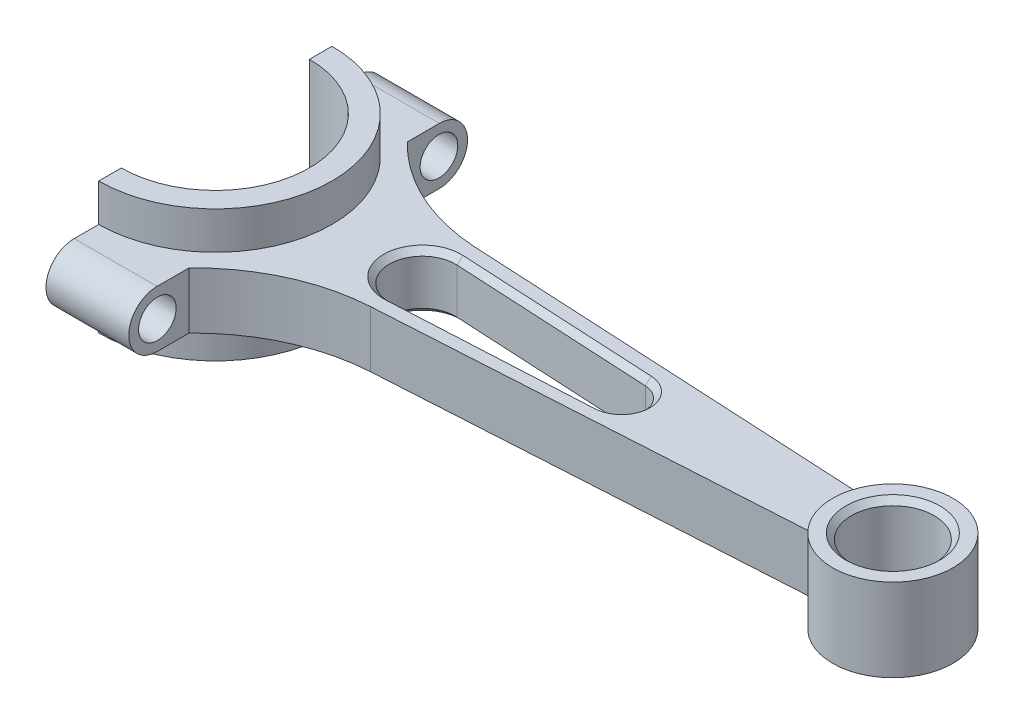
from build123d import *

# Parameters (mm, degrees)
BOSS_EXTRUDE1_DEPTH = 7.5
SKETCH1_15_R        = 16
SKETCH1_15_R_2      = 11
BOSS_EXTRUDE2_DEPTH = 11
BOSS_EXTRUDE3_DEPTH = 17.5
FILLET1_RADIUS      = 7.5
FILLET1_LENGTH      = 22
FILLET2_RADIUS      = 7.5
FILLET2_LENGTH      = 22
HOLE2_D             = 10
CHAMFER1_SIZE       = 1.5


with BuildPart() as part:
    # Sketch1 → Boss-Extrude1 (new, symmetric)
    with BuildSketch(Plane(origin=(0, 0, 0), x_dir=(1, 0, 0), z_dir=(0, 1, 0))):
        with BuildLine():
            Line((0, 45), (0, 31))
            ThreePointArc((0, 31), (31, 0), (0, -31))
            Line((0, -31), (0, -45))
            Line((0, -45), (22, -45))
            Line((22, -45), (22, -29))
            ThreePointArc((22, -29), (37.069274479, -18.290502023), (55, -13.788784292))
            Line((55, -13.788784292), (165.679487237, -7.136029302))
            ThreePointArc((165.679487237, -7.136029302), (164.00691086, 0.470212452), (166.123473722, 7.965049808))
            Line((166.123473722, 7.965049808), (55, 13.788784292))
            ThreePointArc((55, 13.788784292), (37.069274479, 18.290502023), (22, 29))
            Line((22, 29), (22, 45))
            Line((22, 45), (0, 45))
        make_face()
        with BuildLine():
            ThreePointArc((55.458980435, -8.757868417), (46.230112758, 0), (55.458980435, 8.757868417))
            Line((55.458980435, 8.757868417), (108.239144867, 5.991777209))
            ThreePointArc((108.239144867, 5.991777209), (113.92512913, 0), (108.239144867, -5.991777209))
            Line((108.239144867, -5.991777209), (55.458980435, -8.757868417))
        make_face(mode=Mode.SUBTRACT)
    extrude(amount=BOSS_EXTRUDE1_DEPTH, both=True)

    # Sketch1_15 → Boss-Extrude2 (add, symmetric)
    with BuildSketch(Plane(origin=(0, 0, 0), x_dir=(1, 0, 0), z_dir=(0, 1, 0))):
        with Locations(Location((180, 0, 0), (0, 0, 270))):
            Circle(SKETCH1_15_R)
        with Locations(Location((180, 0, 0), (0, 0, 270))):
            Circle(SKETCH1_15_R_2, mode=Mode.SUBTRACT)
    extrude(amount=BOSS_EXTRUDE2_DEPTH, both=True)

    # Sketch1_16 → Boss-Extrude3 (add, symmetric)
    with BuildSketch(Plane(origin=(0, 0, 0), x_dir=(1, 0, 0), z_dir=(0, 1, 0))):
        with BuildLine():
            Line((0, 31), (0, 25))
            ThreePointArc((0, 25), (25, 0), (0, -25))
            Line((0, -25), (0, -31))
            ThreePointArc((0, -31), (31, 0), (0, 31))
        make_face()
    extrude(amount=BOSS_EXTRUDE3_DEPTH, both=True)

    # Fillet1: full round fillet: the end face becomes a half cylinder, R = half its width
    fillet1_face = Plane((11, 0, 45), x_dir=(1, 0, 0), z_dir=(0, 0, 1))  # on the end face: x along it, z out of the body
    fillet1_slab = fillet1_face.offset(-FILLET1_RADIUS / 2) * Box(FILLET1_LENGTH, 2 * FILLET1_RADIUS, FILLET1_RADIUS, mode=Mode.PRIVATE)  # the body's end, R deep
    fillet1_round = Plane((11, 0, 37.5), x_dir=(0, 0, 1), z_dir=(1, 0, 0)) * Cylinder(FILLET1_RADIUS, FILLET1_LENGTH, mode=Mode.PRIVATE)  # its axis R under the face
    add(fillet1_slab - fillet1_round, mode=Mode.SUBTRACT)

    # Fillet2: full round fillet: the end face becomes a half cylinder, R = half its width
    fillet2_face = Plane((11, 0, -45), x_dir=(-1, 0, 0), z_dir=(0, 0, -1))  # on the end face: x along it, z out of the body
    fillet2_slab = fillet2_face.offset(-FILLET2_RADIUS / 2) * Box(FILLET2_LENGTH, 2 * FILLET2_RADIUS, FILLET2_RADIUS, mode=Mode.PRIVATE)  # the body's end, R deep
    fillet2_round = Plane((11, 0, -37.5), x_dir=(0, 0, -1), z_dir=(-1, 0, 0)) * Cylinder(FILLET2_RADIUS, FILLET2_LENGTH, mode=Mode.PRIVATE)  # its axis R under the face
    add(fillet2_slab - fillet2_round, mode=Mode.SUBTRACT)

    # Hole2 (through all)
    with Locations(Plane(origin=(22, 0, 0), x_dir=(0, 0, -1), z_dir=(1, 0, 0))):
        with Locations((-37.406838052, 0)):
            hole2 = Hole(HOLE2_D / 2)

    # Mirror1: Hole2 across plane
    add(hole2.mirror(Plane.XY), mode=Mode.SUBTRACT)

    # Chamfer1
    chamfer1_edges = [part.edges().sort_by_distance(p)[0] for p in [
        (81.849062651, 7.5, -7.374822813),
        (113.92512913, 7.5, 0),
        (81.849062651, 7.5, 7.374822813),
        (81.849062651, -7.5, 7.374822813),
        (113.92512913, -7.5, 0),
        (81.849062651, -7.5, -7.374822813),
        (46.230112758, -7.5, 0),
        (180, 11, -11),
        (180, -11, -11),
        (46.230112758, 7.5, 0),
    ]]
    chamfer(chamfer1_edges, length=CHAMFER1_SIZE)


solid = part.part
